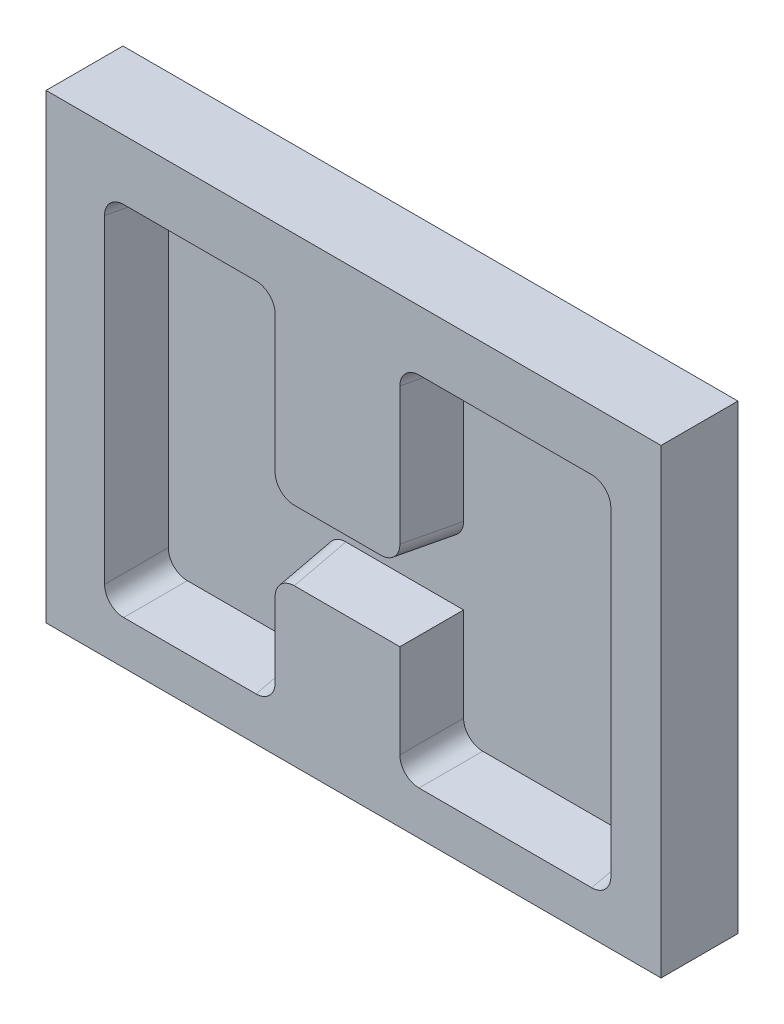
from build123d import *

# Parameters (mm, degrees)
SKETCH1_W          = 203.2
SKETCH1_H          = 152.4
EXTRUDE1_DEPTH     = 25.4
CUT_EXTRUDE1_DEPTH = 19.05
CUT_EXTRUDE1_DRAFT = -6
FILLET1_R          = 6.35


with BuildPart() as part:
    # Sketch1 → Extrude1 (new body)
    with BuildSketch(Plane.XY):
        with Locations((101.6, 76.2)):
            Rectangle(SKETCH1_W, SKETCH1_H)
    extrude(amount=EXTRUDE1_DEPTH)


with BuildPart() as cut_extrude1_tool:
    # Sketch2 → Cut-Extrude1 (with draft: the straight prism first)
    with BuildSketch(Plane.XY.offset(25.4)):
        Polygon((19.319910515, 132.568680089), (19.319910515, 14.376286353), (75.688590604, 14.376286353), (75.688590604, 51.652348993), (116.904399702, 51.652348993), (116.904399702, 14.376286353), (186.607606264, 14.376286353), (186.607606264, 132.568680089), (116.904399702, 132.568680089), (116.904399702, 74.684712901), (75.688590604, 74.684712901), (75.688590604, 132.568680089), align=None)
    extrude(amount=-CUT_EXTRUDE1_DEPTH)
    # Cut-Extrude1: the draft: its side faces are tilted about the plane it starts from
    cut_extrude1_sides = [cut_extrude1_tool.faces().sort_by_distance(p)[0] for p in [
        (19.319910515, 73.472483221, 15.875),
        (47.504250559, 14.376286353, 15.875),
        (75.688590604, 33.014317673, 15.875),
        (96.296495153, 51.652348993, 15.875),
        (116.904399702, 33.014317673, 15.875),
        (151.756002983, 14.376286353, 15.875),
        (186.607606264, 73.472483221, 15.875),
        (151.756002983, 132.568680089, 15.875),
        (116.904399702, 103.626696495, 15.875),
        (96.296495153, 74.684712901, 15.875),
        (75.688590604, 103.626696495, 15.875),
        (47.504250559, 132.568680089, 15.875),
    ]]
    draft(cut_extrude1_sides, Plane.XY.offset(25.4), CUT_EXTRUDE1_DRAFT)


with BuildPart() as part_1:
    add(part.part)

    # Cut-Extrude1: cut by cut_extrude1_tool
    add(cut_extrude1_tool.part, mode=Mode.SUBTRACT)

    # Fillet1
    fillet1_edges = [part_1.edges().sort_by_distance(p)[0] for p in [
        (20.321028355, 15.377404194, 15.875),
        (20.321028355, 131.567562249, 15.875),
        (74.687472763, 131.567562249, 15.875),
        (74.687472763, 73.68359506, 15.875),
        (117.905517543, 73.68359506, 15.875),
        (117.905517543, 131.567562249, 15.875),
        (185.606488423, 131.567562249, 15.875),
        (185.606488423, 15.377404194, 15.875),
        (117.905517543, 15.377404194, 15.875),
        (74.687472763, 52.653466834, 15.875),
        (74.687472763, 15.377404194, 15.875),
    ]]
    fillet(fillet1_edges, radius=FILLET1_R)


solid = part_1.part
